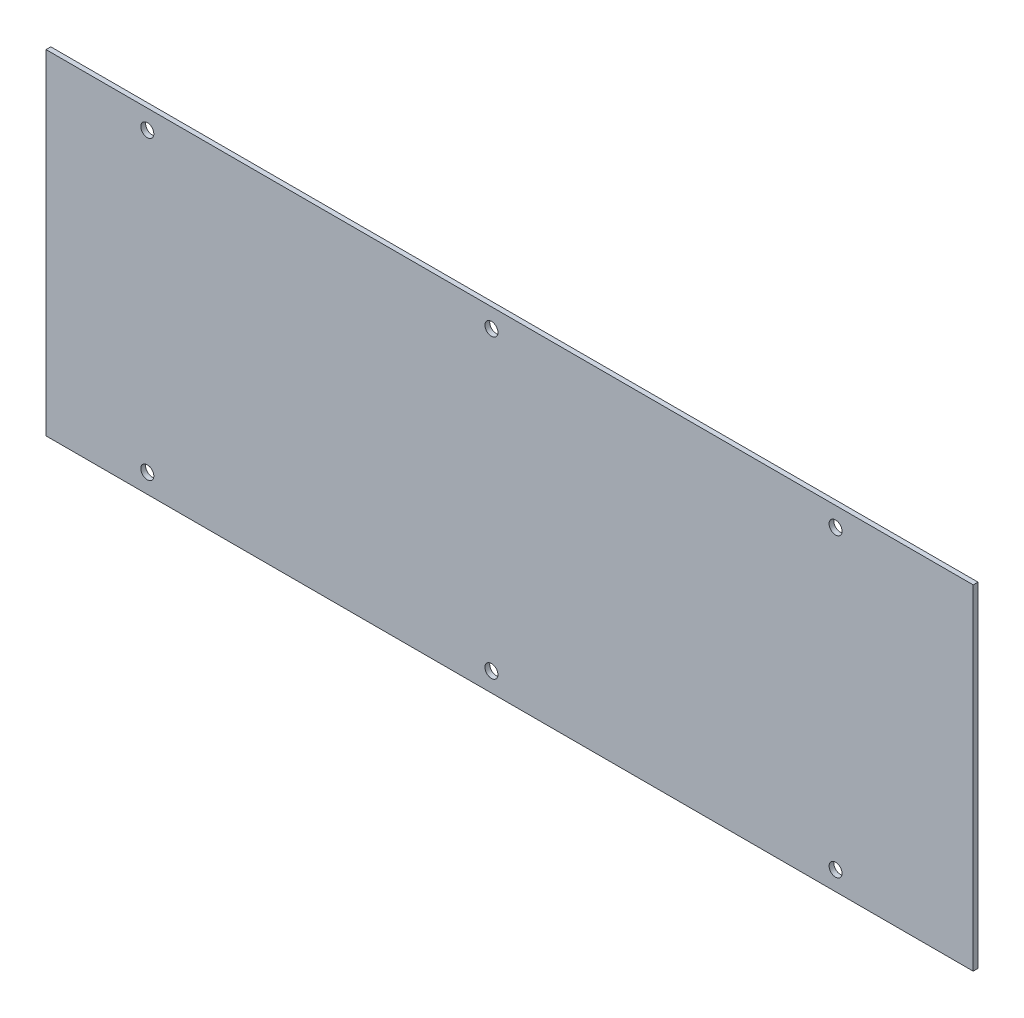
ISO-10303-21;
HEADER;
FILE_DESCRIPTION(('STEP AP214'),'2;1');
FILE_NAME('part.step','',(''),(''),'','','');
FILE_SCHEMA(('AUTOMOTIVE_DESIGN { 1 0 10303 214 1 1 1 1 }'));
ENDSEC;
DATA;
#1=APPLICATION_CONTEXT('core data for automotive mechanical design processes');
#2=APPLICATION_PROTOCOL_DEFINITION('international standard','automotive_design',2000,#1);
#3=PRODUCT_CONTEXT('',#1,'mechanical');
#4=PRODUCT('Part','Part','',(#3));
#5=PRODUCT_RELATED_PRODUCT_CATEGORY('part','',(#4));
#6=PRODUCT_DEFINITION_FORMATION('','',#4);
#7=PRODUCT_DEFINITION_CONTEXT('part definition',#1,'design');
#8=PRODUCT_DEFINITION('design','',#6,#7);
#9=PRODUCT_DEFINITION_SHAPE('','',#8);
#10=(LENGTH_UNIT() NAMED_UNIT(*) SI_UNIT(.MILLI.,.METRE.));
#11=(NAMED_UNIT(*) PLANE_ANGLE_UNIT() SI_UNIT($,.RADIAN.));
#12=(NAMED_UNIT(*) SI_UNIT($,.STERADIAN.) SOLID_ANGLE_UNIT());
#13=UNCERTAINTY_MEASURE_WITH_UNIT(LENGTH_MEASURE(1.E-05),#10,'distance_accuracy_value','');
#14=(GEOMETRIC_REPRESENTATION_CONTEXT(3) GLOBAL_UNCERTAINTY_ASSIGNED_CONTEXT((#13)) GLOBAL_UNIT_ASSIGNED_CONTEXT((#10,
#11,#12)) REPRESENTATION_CONTEXT('',''));
#15=CARTESIAN_POINT('',(0.,0.,0.));
#16=DIRECTION('',(0.,0.,1.));
#17=DIRECTION('',(1.,0.,0.));
#18=AXIS2_PLACEMENT_3D('',#15,#16,#17);
#19=CARTESIAN_POINT('',(0.,0.,2.5));
#20=DIRECTION('',(1.,0.,0.));
#21=DIRECTION('',(0.,0.,-1.));
#22=AXIS2_PLACEMENT_3D('',#19,#20,#21);
#23=PLANE('',#22);
#24=DIRECTION('',(0.,-1.,0.));
#25=VECTOR('',#24,1.);
#26=CARTESIAN_POINT('',(0.,0.,0.));
#27=LINE('',#26,#25);
#28=CARTESIAN_POINT('',(0.,175.,0.));
#29=VERTEX_POINT('',#28);
#30=CARTESIAN_POINT('',(0.,0.,0.));
#31=VERTEX_POINT('',#30);
#32=EDGE_CURVE('E83',#29,#31,#27,.T.);
#33=ORIENTED_EDGE('',*,*,#32,.T.);
#34=DIRECTION('',(0.,0.,-1.));
#35=VECTOR('',#34,1.);
#36=CARTESIAN_POINT('',(0.,0.,2.5));
#37=LINE('',#36,#35);
#38=CARTESIAN_POINT('',(0.,0.,2.5));
#39=VERTEX_POINT('',#38);
#40=EDGE_CURVE('E11',#39,#31,#37,.T.);
#41=ORIENTED_EDGE('',*,*,#40,.F.);
#42=DIRECTION('',(0.,-1.,0.));
#43=VECTOR('',#42,1.);
#44=CARTESIAN_POINT('',(0.,0.,2.5));
#45=LINE('',#44,#43);
#46=CARTESIAN_POINT('',(0.,175.,2.5));
#47=VERTEX_POINT('',#46);
#48=EDGE_CURVE('E112',#47,#39,#45,.T.);
#49=ORIENTED_EDGE('',*,*,#48,.F.);
#50=DIRECTION('',(0.,0.,-1.));
#51=VECTOR('',#50,1.);
#52=CARTESIAN_POINT('',(0.,175.,2.5));
#53=LINE('',#52,#51);
#54=EDGE_CURVE('E96',#47,#29,#53,.T.);
#55=ORIENTED_EDGE('',*,*,#54,.T.);
#56=EDGE_LOOP('',(#33,#41,#49,#55));
#57=FACE_BOUND('',#56,.T.);
#58=ADVANCED_FACE('F38',(#57),#23,.F.);
#59=CARTESIAN_POINT('',(0.,0.,2.5));
#60=DIRECTION('',(0.,1.,0.));
#61=DIRECTION('',(0.,0.,1.));
#62=AXIS2_PLACEMENT_3D('',#59,#60,#61);
#63=PLANE('',#62);
#64=DIRECTION('',(1.,0.,0.));
#65=VECTOR('',#64,1.);
#66=CARTESIAN_POINT('',(0.,0.,0.));
#67=LINE('',#66,#65);
#68=CARTESIAN_POINT('',(485.,0.,0.));
#69=VERTEX_POINT('',#68);
#70=EDGE_CURVE('E79',#31,#69,#67,.T.);
#71=ORIENTED_EDGE('',*,*,#70,.T.);
#72=DIRECTION('',(0.,0.,-1.));
#73=VECTOR('',#72,1.);
#74=CARTESIAN_POINT('',(485.,0.,2.5));
#75=LINE('',#74,#73);
#76=CARTESIAN_POINT('',(485.,0.,2.5));
#77=VERTEX_POINT('',#76);
#78=EDGE_CURVE('E46',#77,#69,#75,.T.);
#79=ORIENTED_EDGE('',*,*,#78,.F.);
#80=DIRECTION('',(1.,0.,0.));
#81=VECTOR('',#80,1.);
#82=CARTESIAN_POINT('',(0.,0.,2.5));
#83=LINE('',#82,#81);
#84=EDGE_CURVE('E92',#39,#77,#83,.T.);
#85=ORIENTED_EDGE('',*,*,#84,.F.);
#86=ORIENTED_EDGE('',*,*,#40,.T.);
#87=EDGE_LOOP('',(#71,#79,#85,#86));
#88=FACE_BOUND('',#87,.T.);
#89=ADVANCED_FACE('F91',(#88),#63,.F.);
#90=CARTESIAN_POINT('',(485.,0.,2.5));
#91=DIRECTION('',(-1.,0.,0.));
#92=DIRECTION('',(0.,0.,1.));
#93=AXIS2_PLACEMENT_3D('',#90,#91,#92);
#94=PLANE('',#93);
#95=DIRECTION('',(0.,1.,0.));
#96=VECTOR('',#95,1.);
#97=CARTESIAN_POINT('',(485.,0.,0.));
#98=LINE('',#97,#96);
#99=CARTESIAN_POINT('',(485.,175.,0.));
#100=VERTEX_POINT('',#99);
#101=EDGE_CURVE('E84',#69,#100,#98,.T.);
#102=ORIENTED_EDGE('',*,*,#101,.T.);
#103=DIRECTION('',(0.,0.,-1.));
#104=VECTOR('',#103,1.);
#105=CARTESIAN_POINT('',(485.,175.,2.5));
#106=LINE('',#105,#104);
#107=CARTESIAN_POINT('',(485.,175.,2.5));
#108=VERTEX_POINT('',#107);
#109=EDGE_CURVE('E122',#108,#100,#106,.T.);
#110=ORIENTED_EDGE('',*,*,#109,.F.);
#111=DIRECTION('',(0.,1.,0.));
#112=VECTOR('',#111,1.);
#113=CARTESIAN_POINT('',(485.,0.,2.5));
#114=LINE('',#113,#112);
#115=EDGE_CURVE('E58',#77,#108,#114,.T.);
#116=ORIENTED_EDGE('',*,*,#115,.F.);
#117=ORIENTED_EDGE('',*,*,#78,.T.);
#118=EDGE_LOOP('',(#102,#110,#116,#117));
#119=FACE_BOUND('',#118,.T.);
#120=ADVANCED_FACE('F128',(#119),#94,.F.);
#121=CARTESIAN_POINT('',(0.,175.,2.5));
#122=DIRECTION('',(0.,-1.,0.));
#123=DIRECTION('',(0.,0.,-1.));
#124=AXIS2_PLACEMENT_3D('',#121,#122,#123);
#125=PLANE('',#124);
#126=DIRECTION('',(-1.,0.,0.));
#127=VECTOR('',#126,1.);
#128=CARTESIAN_POINT('',(0.,175.,0.));
#129=LINE('',#128,#127);
#130=EDGE_CURVE('E109',#100,#29,#129,.T.);
#131=ORIENTED_EDGE('',*,*,#130,.T.);
#132=ORIENTED_EDGE('',*,*,#54,.F.);
#133=DIRECTION('',(-1.,0.,0.));
#134=VECTOR('',#133,1.);
#135=CARTESIAN_POINT('',(0.,175.,2.5));
#136=LINE('',#135,#134);
#137=EDGE_CURVE('E53',#108,#47,#136,.T.);
#138=ORIENTED_EDGE('',*,*,#137,.F.);
#139=ORIENTED_EDGE('',*,*,#109,.T.);
#140=EDGE_LOOP('',(#131,#132,#138,#139));
#141=FACE_BOUND('',#140,.T.);
#142=ADVANCED_FACE('F130',(#141),#125,.F.);
#143=CARTESIAN_POINT('',(0.,175.,2.5));
#144=DIRECTION('',(0.,0.,-1.));
#145=DIRECTION('',(-1.,0.,0.));
#146=AXIS2_PLACEMENT_3D('',#143,#144,#145);
#147=PLANE('',#146);
#148=CARTESIAN_POINT('',(233.,9.99999999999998,2.5));
#149=DIRECTION('',(0.,0.,1.));
#150=DIRECTION('',(1.,0.,0.));
#151=AXIS2_PLACEMENT_3D('',#148,#149,#150);
#152=CIRCLE('',#151,3.39999999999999);
#153=CARTESIAN_POINT('',(236.4,9.99999999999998,2.5));
#154=VERTEX_POINT('',#153);
#155=EDGE_CURVE('E271',#154,#154,#152,.T.);
#156=ORIENTED_EDGE('',*,*,#155,.F.);
#157=EDGE_LOOP('',(#156));
#158=FACE_BOUND('',#157,.T.);
#159=CARTESIAN_POINT('',(413.,165.,2.5));
#160=DIRECTION('',(0.,0.,1.));
#161=DIRECTION('',(1.,0.,0.));
#162=AXIS2_PLACEMENT_3D('',#159,#160,#161);
#163=CIRCLE('',#162,3.40000000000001);
#164=CARTESIAN_POINT('',(416.4,165.,2.5));
#165=VERTEX_POINT('',#164);
#166=EDGE_CURVE('E276',#165,#165,#163,.T.);
#167=ORIENTED_EDGE('',*,*,#166,.F.);
#168=EDGE_LOOP('',(#167));
#169=FACE_BOUND('',#168,.T.);
#170=CARTESIAN_POINT('',(233.,165.,2.5));
#171=DIRECTION('',(0.,0.,1.));
#172=DIRECTION('',(1.,0.,0.));
#173=AXIS2_PLACEMENT_3D('',#170,#171,#172);
#174=CIRCLE('',#173,3.39999999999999);
#175=CARTESIAN_POINT('',(236.4,165.,2.5));
#176=VERTEX_POINT('',#175);
#177=EDGE_CURVE('E286',#176,#176,#174,.T.);
#178=ORIENTED_EDGE('',*,*,#177,.F.);
#179=EDGE_LOOP('',(#178));
#180=FACE_BOUND('',#179,.T.);
#181=CARTESIAN_POINT('',(53.,165.,2.5));
#182=DIRECTION('',(0.,0.,1.));
#183=DIRECTION('',(1.,0.,0.));
#184=AXIS2_PLACEMENT_3D('',#181,#182,#183);
#185=CIRCLE('',#184,3.39999999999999);
#186=CARTESIAN_POINT('',(56.4,165.,2.5));
#187=VERTEX_POINT('',#186);
#188=EDGE_CURVE('E293',#187,#187,#185,.T.);
#189=ORIENTED_EDGE('',*,*,#188,.F.);
#190=EDGE_LOOP('',(#189));
#191=FACE_BOUND('',#190,.T.);
#192=CARTESIAN_POINT('',(53.,9.99999999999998,2.5));
#193=DIRECTION('',(0.,0.,1.));
#194=DIRECTION('',(1.,0.,0.));
#195=AXIS2_PLACEMENT_3D('',#192,#193,#194);
#196=CIRCLE('',#195,3.39999999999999);
#197=CARTESIAN_POINT('',(56.4,9.99999999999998,2.5));
#198=VERTEX_POINT('',#197);
#199=EDGE_CURVE('E301',#198,#198,#196,.T.);
#200=ORIENTED_EDGE('',*,*,#199,.F.);
#201=EDGE_LOOP('',(#200));
#202=FACE_BOUND('',#201,.T.);
#203=CARTESIAN_POINT('',(413.,9.99999999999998,2.5));
#204=DIRECTION('',(0.,0.,1.));
#205=DIRECTION('',(1.,0.,0.));
#206=AXIS2_PLACEMENT_3D('',#203,#204,#205);
#207=CIRCLE('',#206,3.40000000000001);
#208=CARTESIAN_POINT('',(416.4,9.99999999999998,2.5));
#209=VERTEX_POINT('',#208);
#210=EDGE_CURVE('E103',#209,#209,#207,.T.);
#211=ORIENTED_EDGE('',*,*,#210,.F.);
#212=EDGE_LOOP('',(#211));
#213=FACE_BOUND('',#212,.T.);
#214=ORIENTED_EDGE('',*,*,#48,.T.);
#215=ORIENTED_EDGE('',*,*,#84,.T.);
#216=ORIENTED_EDGE('',*,*,#115,.T.);
#217=ORIENTED_EDGE('',*,*,#137,.T.);
#218=EDGE_LOOP('',(#214,#215,#216,#217));
#219=FACE_BOUND('',#218,.T.);
#220=ADVANCED_FACE('F131',(#158,#169,#180,#191,#202,#213,#219),#147,.F.);
#221=CARTESIAN_POINT('',(0.,175.,0.));
#222=DIRECTION('',(0.,0.,-1.));
#223=DIRECTION('',(-1.,0.,0.));
#224=AXIS2_PLACEMENT_3D('',#221,#222,#223);
#225=PLANE('',#224);
#226=CARTESIAN_POINT('',(233.,9.99999999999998,0.));
#227=DIRECTION('',(0.,0.,1.));
#228=DIRECTION('',(1.,0.,0.));
#229=AXIS2_PLACEMENT_3D('',#226,#227,#228);
#230=CIRCLE('',#229,3.39999999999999);
#231=CARTESIAN_POINT('',(236.4,9.99999999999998,0.));
#232=VERTEX_POINT('',#231);
#233=EDGE_CURVE('E269',#232,#232,#230,.T.);
#234=ORIENTED_EDGE('',*,*,#233,.T.);
#235=EDGE_LOOP('',(#234));
#236=FACE_BOUND('',#235,.T.);
#237=CARTESIAN_POINT('',(413.,165.,0.));
#238=DIRECTION('',(0.,0.,1.));
#239=DIRECTION('',(1.,0.,0.));
#240=AXIS2_PLACEMENT_3D('',#237,#238,#239);
#241=CIRCLE('',#240,3.40000000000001);
#242=CARTESIAN_POINT('',(416.4,165.,0.));
#243=VERTEX_POINT('',#242);
#244=EDGE_CURVE('E282',#243,#243,#241,.T.);
#245=ORIENTED_EDGE('',*,*,#244,.T.);
#246=EDGE_LOOP('',(#245));
#247=FACE_BOUND('',#246,.T.);
#248=CARTESIAN_POINT('',(233.,165.,0.));
#249=DIRECTION('',(0.,0.,1.));
#250=DIRECTION('',(1.,0.,0.));
#251=AXIS2_PLACEMENT_3D('',#248,#249,#250);
#252=CIRCLE('',#251,3.39999999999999);
#253=CARTESIAN_POINT('',(236.4,165.,0.));
#254=VERTEX_POINT('',#253);
#255=EDGE_CURVE('E290',#254,#254,#252,.T.);
#256=ORIENTED_EDGE('',*,*,#255,.T.);
#257=EDGE_LOOP('',(#256));
#258=FACE_BOUND('',#257,.T.);
#259=CARTESIAN_POINT('',(53.,165.,0.));
#260=DIRECTION('',(0.,0.,1.));
#261=DIRECTION('',(1.,0.,0.));
#262=AXIS2_PLACEMENT_3D('',#259,#260,#261);
#263=CIRCLE('',#262,3.4);
#264=CARTESIAN_POINT('',(56.4,165.,0.));
#265=VERTEX_POINT('',#264);
#266=EDGE_CURVE('E297',#265,#265,#263,.T.);
#267=ORIENTED_EDGE('',*,*,#266,.T.);
#268=EDGE_LOOP('',(#267));
#269=FACE_BOUND('',#268,.T.);
#270=CARTESIAN_POINT('',(53.,9.99999999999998,0.));
#271=DIRECTION('',(0.,0.,1.));
#272=DIRECTION('',(1.,0.,0.));
#273=AXIS2_PLACEMENT_3D('',#270,#271,#272);
#274=CIRCLE('',#273,3.4);
#275=CARTESIAN_POINT('',(56.4,9.99999999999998,0.));
#276=VERTEX_POINT('',#275);
#277=EDGE_CURVE('E304',#276,#276,#274,.T.);
#278=ORIENTED_EDGE('',*,*,#277,.T.);
#279=EDGE_LOOP('',(#278));
#280=FACE_BOUND('',#279,.T.);
#281=CARTESIAN_POINT('',(413.,9.99999999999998,0.));
#282=DIRECTION('',(0.,0.,1.));
#283=DIRECTION('',(1.,0.,0.));
#284=AXIS2_PLACEMENT_3D('',#281,#282,#283);
#285=CIRCLE('',#284,3.40000000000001);
#286=CARTESIAN_POINT('',(416.4,9.99999999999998,0.));
#287=VERTEX_POINT('',#286);
#288=EDGE_CURVE('E98',#287,#287,#285,.T.);
#289=ORIENTED_EDGE('',*,*,#288,.T.);
#290=EDGE_LOOP('',(#289));
#291=FACE_BOUND('',#290,.T.);
#292=ORIENTED_EDGE('',*,*,#32,.F.);
#293=ORIENTED_EDGE('',*,*,#130,.F.);
#294=ORIENTED_EDGE('',*,*,#101,.F.);
#295=ORIENTED_EDGE('',*,*,#70,.F.);
#296=EDGE_LOOP('',(#292,#293,#294,#295));
#297=FACE_BOUND('',#296,.T.);
#298=ADVANCED_FACE('F80',(#236,#247,#258,#269,#280,#291,#297),#225,.T.);
#299=CARTESIAN_POINT('',(413.,9.99999999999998,2.5));
#300=DIRECTION('',(0.,0.,1.));
#301=DIRECTION('',(1.,0.,0.));
#302=AXIS2_PLACEMENT_3D('',#299,#300,#301);
#303=CYLINDRICAL_SURFACE('',#302,3.40000000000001);
#304=ORIENTED_EDGE('',*,*,#288,.F.);
#305=EDGE_LOOP('',(#304));
#306=FACE_BOUND('',#305,.T.);
#307=ORIENTED_EDGE('',*,*,#210,.T.);
#308=EDGE_LOOP('',(#307));
#309=FACE_BOUND('',#308,.T.);
#310=ADVANCED_FACE('F139',(#306,#309),#303,.F.);
#311=CARTESIAN_POINT('',(53.,9.99999999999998,2.5));
#312=DIRECTION('',(0.,0.,1.));
#313=DIRECTION('',(1.,0.,0.));
#314=AXIS2_PLACEMENT_3D('',#311,#312,#313);
#315=CYLINDRICAL_SURFACE('',#314,3.39999999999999);
#316=ORIENTED_EDGE('',*,*,#277,.F.);
#317=EDGE_LOOP('',(#316));
#318=FACE_BOUND('',#317,.T.);
#319=ORIENTED_EDGE('',*,*,#199,.T.);
#320=EDGE_LOOP('',(#319));
#321=FACE_BOUND('',#320,.T.);
#322=ADVANCED_FACE('F173',(#318,#321),#315,.F.);
#323=CARTESIAN_POINT('',(53.,165.,2.5));
#324=DIRECTION('',(0.,0.,1.));
#325=DIRECTION('',(1.,0.,0.));
#326=AXIS2_PLACEMENT_3D('',#323,#324,#325);
#327=CYLINDRICAL_SURFACE('',#326,3.39999999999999);
#328=ORIENTED_EDGE('',*,*,#266,.F.);
#329=EDGE_LOOP('',(#328));
#330=FACE_BOUND('',#329,.T.);
#331=ORIENTED_EDGE('',*,*,#188,.T.);
#332=EDGE_LOOP('',(#331));
#333=FACE_BOUND('',#332,.T.);
#334=ADVANCED_FACE('F182',(#330,#333),#327,.F.);
#335=CARTESIAN_POINT('',(233.,165.,2.5));
#336=DIRECTION('',(0.,0.,1.));
#337=DIRECTION('',(1.,0.,0.));
#338=AXIS2_PLACEMENT_3D('',#335,#336,#337);
#339=CYLINDRICAL_SURFACE('',#338,3.39999999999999);
#340=ORIENTED_EDGE('',*,*,#255,.F.);
#341=EDGE_LOOP('',(#340));
#342=FACE_BOUND('',#341,.T.);
#343=ORIENTED_EDGE('',*,*,#177,.T.);
#344=EDGE_LOOP('',(#343));
#345=FACE_BOUND('',#344,.T.);
#346=ADVANCED_FACE('F191',(#342,#345),#339,.F.);
#347=CARTESIAN_POINT('',(413.,165.,2.5));
#348=DIRECTION('',(0.,0.,1.));
#349=DIRECTION('',(1.,0.,0.));
#350=AXIS2_PLACEMENT_3D('',#347,#348,#349);
#351=CYLINDRICAL_SURFACE('',#350,3.40000000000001);
#352=ORIENTED_EDGE('',*,*,#244,.F.);
#353=EDGE_LOOP('',(#352));
#354=FACE_BOUND('',#353,.T.);
#355=ORIENTED_EDGE('',*,*,#166,.T.);
#356=EDGE_LOOP('',(#355));
#357=FACE_BOUND('',#356,.T.);
#358=ADVANCED_FACE('F200',(#354,#357),#351,.F.);
#359=CARTESIAN_POINT('',(233.,9.99999999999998,2.5));
#360=DIRECTION('',(0.,0.,1.));
#361=DIRECTION('',(1.,0.,0.));
#362=AXIS2_PLACEMENT_3D('',#359,#360,#361);
#363=CYLINDRICAL_SURFACE('',#362,3.39999999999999);
#364=ORIENTED_EDGE('',*,*,#233,.F.);
#365=EDGE_LOOP('',(#364));
#366=FACE_BOUND('',#365,.T.);
#367=ORIENTED_EDGE('',*,*,#155,.T.);
#368=EDGE_LOOP('',(#367));
#369=FACE_BOUND('',#368,.T.);
#370=ADVANCED_FACE('F209',(#366,#369),#363,.F.);
#371=CLOSED_SHELL('',(#58,#89,#120,#142,#220,#298,#310,#322,#334,#346,#358,#370));
#372=MANIFOLD_SOLID_BREP('B2',#371);
#373=ADVANCED_BREP_SHAPE_REPRESENTATION('',(#18,#372),#14);
#374=SHAPE_DEFINITION_REPRESENTATION(#9,#373);
ENDSEC;
END-ISO-10303-21;
